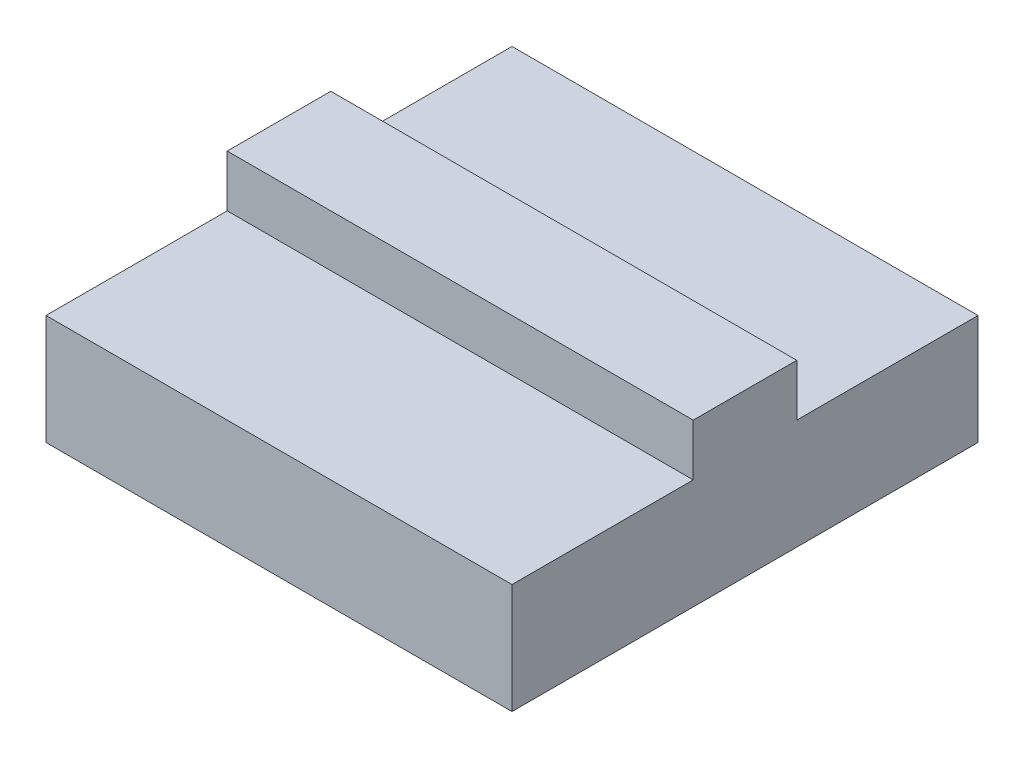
from build123d import *

# Parameters (mm, degrees)
SKETCH1_W           = 90
SKETCH1_H           = 90
BOSS_EXTRUDE1_DEPTH = 21.25
SKETCH2_W           = 20
SKETCH2_H           = 10
BOSS_EXTRUDE2_DEPTH = 90


with BuildPart() as part:
    # Sketch1 → Boss-Extrude1 (new body)
    with BuildSketch(Plane(origin=(0, 0, 0), x_dir=(1, 0, 0), z_dir=(0, 1, 0))):
        Rectangle(SKETCH1_W, SKETCH1_H)
    extrude(amount=BOSS_EXTRUDE1_DEPTH)

    # Sketch2 → Boss-Extrude2 (add)
    with BuildSketch(Plane(origin=(45, 0, 0), x_dir=(0, 0, -1), z_dir=(1, 0, 0))):
        with Locations((0, 26.25)):
            Rectangle(SKETCH2_W, SKETCH2_H)
    extrude(amount=-BOSS_EXTRUDE2_DEPTH)


solid = part.part
